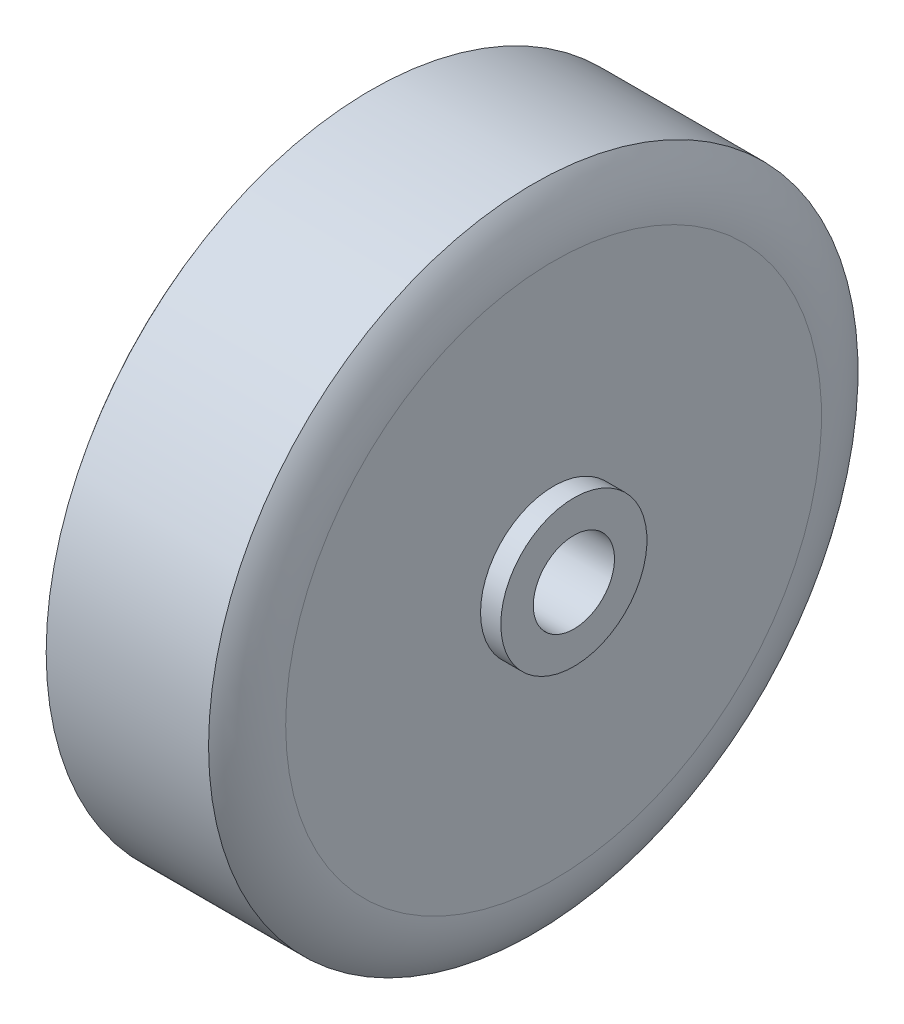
from build123d import *


with BuildPart() as part:
    # Esquisse1 → R_volution1 (revolve)
    with BuildSketch(Plane.XY, mode=Mode.PRIVATE) as r_volution1_sk:
        with BuildLine():
            Line((30, 10), (-30, 10))
            Line((-30, 10), (-30, 18))
            Line((-30, 18), (-25, 18))
            Line((-25, 18), (-25, 66))
            ThreePointArc((-25, 66), (-23.712496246, 73.433034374), (-20, 80))
            Line((-20, 80), (20, 80))
            ThreePointArc((20, 80), (23.712496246, 73.433034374), (25, 66))
            Line((25, 66), (25, 18))
            Line((25, 18), (30, 18))
            Line((30, 18), (30, 10))
        make_face()
    revolve(r_volution1_sk.sketch.rotate(Axis((-30, 0, 0), (1, 0, 0)), 90), axis=Axis((-30, 0, 0), (1, 0, 0)))


solid = part.part
